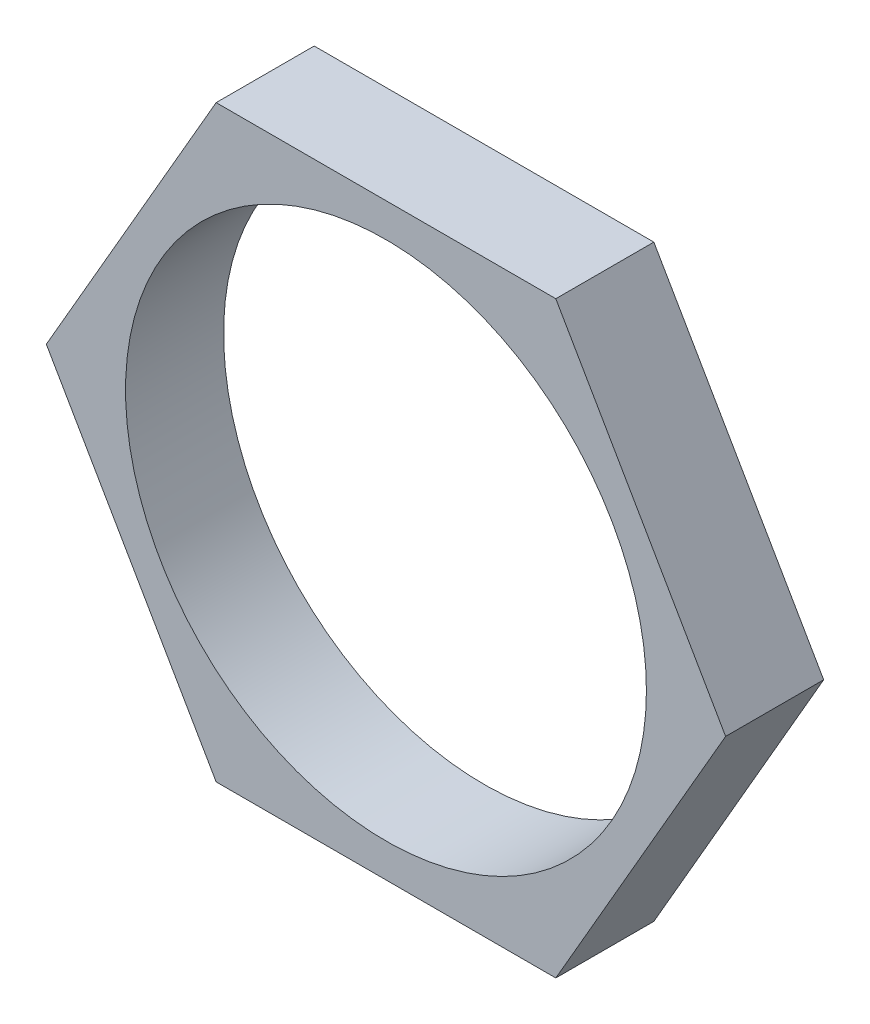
ISO-10303-21;
HEADER;
FILE_DESCRIPTION(('STEP AP214'),'2;1');
FILE_NAME('part.step','',(''),(''),'','','');
FILE_SCHEMA(('AUTOMOTIVE_DESIGN { 1 0 10303 214 1 1 1 1 }'));
ENDSEC;
DATA;
#1=APPLICATION_CONTEXT('core data for automotive mechanical design processes');
#2=APPLICATION_PROTOCOL_DEFINITION('international standard','automotive_design',2000,#1);
#3=PRODUCT_CONTEXT('',#1,'mechanical');
#4=PRODUCT('Part','Part','',(#3));
#5=PRODUCT_RELATED_PRODUCT_CATEGORY('part','',(#4));
#6=PRODUCT_DEFINITION_FORMATION('','',#4);
#7=PRODUCT_DEFINITION_CONTEXT('part definition',#1,'design');
#8=PRODUCT_DEFINITION('design','',#6,#7);
#9=PRODUCT_DEFINITION_SHAPE('','',#8);
#10=(LENGTH_UNIT() NAMED_UNIT(*) SI_UNIT(.MILLI.,.METRE.));
#11=(NAMED_UNIT(*) PLANE_ANGLE_UNIT() SI_UNIT($,.RADIAN.));
#12=(NAMED_UNIT(*) SI_UNIT($,.STERADIAN.) SOLID_ANGLE_UNIT());
#13=UNCERTAINTY_MEASURE_WITH_UNIT(LENGTH_MEASURE(1.E-05),#10,'distance_accuracy_value','');
#14=(GEOMETRIC_REPRESENTATION_CONTEXT(3) GLOBAL_UNCERTAINTY_ASSIGNED_CONTEXT((#13)) GLOBAL_UNIT_ASSIGNED_CONTEXT((#10,
#11,#12)) REPRESENTATION_CONTEXT('',''));
#15=CARTESIAN_POINT('',(0.,0.,0.));
#16=DIRECTION('',(0.,0.,1.));
#17=DIRECTION('',(1.,0.,0.));
#18=AXIS2_PLACEMENT_3D('',#15,#16,#17);
#19=CARTESIAN_POINT('',(-27.712812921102,0.,8.));
#20=DIRECTION('',(0.,0.,1.));
#21=DIRECTION('',(1.,0.,0.));
#22=AXIS2_PLACEMENT_3D('',#19,#20,#21);
#23=PLANE('',#22);
#24=DIRECTION('',(-0.5,-0.866025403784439,0.));
#25=VECTOR('',#24,1.);
#26=CARTESIAN_POINT('',(-13.856406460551,24.,8.));
#27=LINE('',#26,#25);
#28=CARTESIAN_POINT('',(-13.856406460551,24.,8.));
#29=VERTEX_POINT('',#28);
#30=CARTESIAN_POINT('',(-27.712812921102,0.,8.));
#31=VERTEX_POINT('',#30);
#32=EDGE_CURVE('E148',#29,#31,#27,.T.);
#33=ORIENTED_EDGE('',*,*,#32,.T.);
#34=DIRECTION('',(0.5,-0.866025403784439,0.));
#35=VECTOR('',#34,1.);
#36=CARTESIAN_POINT('',(-27.712812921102,0.,8.));
#37=LINE('',#36,#35);
#38=CARTESIAN_POINT('',(-13.856406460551,-24.,8.));
#39=VERTEX_POINT('',#38);
#40=EDGE_CURVE('E95',#31,#39,#37,.T.);
#41=ORIENTED_EDGE('',*,*,#40,.T.);
#42=DIRECTION('',(1.,0.,0.));
#43=VECTOR('',#42,1.);
#44=CARTESIAN_POINT('',(-13.856406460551,-24.,8.));
#45=LINE('',#44,#43);
#46=CARTESIAN_POINT('',(13.856406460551,-24.,8.));
#47=VERTEX_POINT('',#46);
#48=EDGE_CURVE('E108',#39,#47,#45,.T.);
#49=ORIENTED_EDGE('',*,*,#48,.T.);
#50=DIRECTION('',(0.5,0.866025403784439,0.));
#51=VECTOR('',#50,1.);
#52=CARTESIAN_POINT('',(13.856406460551,-24.,8.));
#53=LINE('',#52,#51);
#54=CARTESIAN_POINT('',(27.712812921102,0.,8.));
#55=VERTEX_POINT('',#54);
#56=EDGE_CURVE('E102',#47,#55,#53,.T.);
#57=ORIENTED_EDGE('',*,*,#56,.T.);
#58=DIRECTION('',(-0.5,0.866025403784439,0.));
#59=VECTOR('',#58,1.);
#60=CARTESIAN_POINT('',(27.712812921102,0.,8.));
#61=LINE('',#60,#59);
#62=CARTESIAN_POINT('',(13.856406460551,24.,8.));
#63=VERTEX_POINT('',#62);
#64=EDGE_CURVE('E106',#55,#63,#61,.T.);
#65=ORIENTED_EDGE('',*,*,#64,.T.);
#66=DIRECTION('',(-1.,0.,0.));
#67=VECTOR('',#66,1.);
#68=CARTESIAN_POINT('',(13.856406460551,24.,8.));
#69=LINE('',#68,#67);
#70=EDGE_CURVE('E58',#63,#29,#69,.T.);
#71=ORIENTED_EDGE('',*,*,#70,.T.);
#72=EDGE_LOOP('',(#33,#41,#49,#57,#65,#71));
#73=FACE_BOUND('',#72,.T.);
#74=CARTESIAN_POINT('',(0.,0.,8.));
#75=DIRECTION('',(0.,0.,1.));
#76=DIRECTION('',(1.,0.,0.));
#77=AXIS2_PLACEMENT_3D('',#74,#75,#76);
#78=CIRCLE('',#77,21.25);
#79=CARTESIAN_POINT('',(21.25,0.,8.));
#80=VERTEX_POINT('',#79);
#81=EDGE_CURVE('E136',#80,#80,#78,.T.);
#82=ORIENTED_EDGE('',*,*,#81,.F.);
#83=EDGE_LOOP('',(#82));
#84=FACE_BOUND('',#83,.T.);
#85=ADVANCED_FACE('F40',(#73,#84),#23,.T.);
#86=CARTESIAN_POINT('',(-27.712812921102,0.,0.));
#87=DIRECTION('',(0.,0.,1.));
#88=DIRECTION('',(1.,0.,0.));
#89=AXIS2_PLACEMENT_3D('',#86,#87,#88);
#90=PLANE('',#89);
#91=DIRECTION('',(-0.5,-0.866025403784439,0.));
#92=VECTOR('',#91,1.);
#93=CARTESIAN_POINT('',(-13.856406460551,24.,0.));
#94=LINE('',#93,#92);
#95=CARTESIAN_POINT('',(-13.856406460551,24.,0.));
#96=VERTEX_POINT('',#95);
#97=CARTESIAN_POINT('',(-27.712812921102,0.,0.));
#98=VERTEX_POINT('',#97);
#99=EDGE_CURVE('E131',#96,#98,#94,.T.);
#100=ORIENTED_EDGE('',*,*,#99,.F.);
#101=DIRECTION('',(-1.,0.,0.));
#102=VECTOR('',#101,1.);
#103=CARTESIAN_POINT('',(13.856406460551,24.,0.));
#104=LINE('',#103,#102);
#105=CARTESIAN_POINT('',(13.856406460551,24.,0.));
#106=VERTEX_POINT('',#105);
#107=EDGE_CURVE('E87',#106,#96,#104,.T.);
#108=ORIENTED_EDGE('',*,*,#107,.F.);
#109=DIRECTION('',(-0.5,0.866025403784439,0.));
#110=VECTOR('',#109,1.);
#111=CARTESIAN_POINT('',(27.712812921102,0.,0.));
#112=LINE('',#111,#110);
#113=CARTESIAN_POINT('',(27.712812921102,0.,0.));
#114=VERTEX_POINT('',#113);
#115=EDGE_CURVE('E81',#114,#106,#112,.T.);
#116=ORIENTED_EDGE('',*,*,#115,.F.);
#117=DIRECTION('',(0.5,0.866025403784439,0.));
#118=VECTOR('',#117,1.);
#119=CARTESIAN_POINT('',(13.856406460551,-24.,0.));
#120=LINE('',#119,#118);
#121=CARTESIAN_POINT('',(13.856406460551,-24.,0.));
#122=VERTEX_POINT('',#121);
#123=EDGE_CURVE('E117',#122,#114,#120,.T.);
#124=ORIENTED_EDGE('',*,*,#123,.F.);
#125=DIRECTION('',(1.,0.,0.));
#126=VECTOR('',#125,1.);
#127=CARTESIAN_POINT('',(-13.856406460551,-24.,0.));
#128=LINE('',#127,#126);
#129=CARTESIAN_POINT('',(-13.856406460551,-24.,0.));
#130=VERTEX_POINT('',#129);
#131=EDGE_CURVE('E139',#130,#122,#128,.T.);
#132=ORIENTED_EDGE('',*,*,#131,.F.);
#133=DIRECTION('',(0.5,-0.866025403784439,0.));
#134=VECTOR('',#133,1.);
#135=CARTESIAN_POINT('',(-27.712812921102,0.,0.));
#136=LINE('',#135,#134);
#137=EDGE_CURVE('E135',#98,#130,#136,.T.);
#138=ORIENTED_EDGE('',*,*,#137,.F.);
#139=EDGE_LOOP('',(#100,#108,#116,#124,#132,#138));
#140=FACE_BOUND('',#139,.T.);
#141=CARTESIAN_POINT('',(0.,0.,0.));
#142=DIRECTION('',(0.,0.,1.));
#143=DIRECTION('',(1.,0.,0.));
#144=AXIS2_PLACEMENT_3D('',#141,#142,#143);
#145=CIRCLE('',#144,21.25);
#146=CARTESIAN_POINT('',(21.25,0.,0.));
#147=VERTEX_POINT('',#146);
#148=EDGE_CURVE('E284',#147,#147,#145,.T.);
#149=ORIENTED_EDGE('',*,*,#148,.T.);
#150=EDGE_LOOP('',(#149));
#151=FACE_BOUND('',#150,.T.);
#152=ADVANCED_FACE('F162',(#140,#151),#90,.F.);
#153=CARTESIAN_POINT('',(-13.856406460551,24.,8.));
#154=DIRECTION('',(0.866025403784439,-0.5,0.));
#155=DIRECTION('',(0.5,0.866025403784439,0.));
#156=AXIS2_PLACEMENT_3D('',#153,#154,#155);
#157=PLANE('',#156);
#158=ORIENTED_EDGE('',*,*,#99,.T.);
#159=DIRECTION('',(0.,0.,-1.));
#160=VECTOR('',#159,1.);
#161=CARTESIAN_POINT('',(-27.712812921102,0.,8.));
#162=LINE('',#161,#160);
#163=EDGE_CURVE('E11',#31,#98,#162,.T.);
#164=ORIENTED_EDGE('',*,*,#163,.F.);
#165=ORIENTED_EDGE('',*,*,#32,.F.);
#166=DIRECTION('',(0.,0.,-1.));
#167=VECTOR('',#166,1.);
#168=CARTESIAN_POINT('',(-13.856406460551,24.,8.));
#169=LINE('',#168,#167);
#170=EDGE_CURVE('E127',#29,#96,#169,.T.);
#171=ORIENTED_EDGE('',*,*,#170,.T.);
#172=EDGE_LOOP('',(#158,#164,#165,#171));
#173=FACE_BOUND('',#172,.T.);
#174=ADVANCED_FACE('F42',(#173),#157,.F.);
#175=CARTESIAN_POINT('',(-27.712812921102,0.,8.));
#176=DIRECTION('',(0.866025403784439,0.5,0.));
#177=DIRECTION('',(-0.5,0.866025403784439,0.));
#178=AXIS2_PLACEMENT_3D('',#175,#176,#177);
#179=PLANE('',#178);
#180=ORIENTED_EDGE('',*,*,#137,.T.);
#181=DIRECTION('',(0.,0.,-1.));
#182=VECTOR('',#181,1.);
#183=CARTESIAN_POINT('',(-13.856406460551,-24.,8.));
#184=LINE('',#183,#182);
#185=EDGE_CURVE('E50',#39,#130,#184,.T.);
#186=ORIENTED_EDGE('',*,*,#185,.F.);
#187=ORIENTED_EDGE('',*,*,#40,.F.);
#188=ORIENTED_EDGE('',*,*,#163,.T.);
#189=EDGE_LOOP('',(#180,#186,#187,#188));
#190=FACE_BOUND('',#189,.T.);
#191=ADVANCED_FACE('F187',(#190),#179,.F.);
#192=CARTESIAN_POINT('',(-13.856406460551,-24.,8.));
#193=DIRECTION('',(0.,1.,0.));
#194=DIRECTION('',(-1.,0.,0.));
#195=AXIS2_PLACEMENT_3D('',#192,#193,#194);
#196=PLANE('',#195);
#197=ORIENTED_EDGE('',*,*,#131,.T.);
#198=DIRECTION('',(0.,0.,-1.));
#199=VECTOR('',#198,1.);
#200=CARTESIAN_POINT('',(13.856406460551,-24.,8.));
#201=LINE('',#200,#199);
#202=EDGE_CURVE('E119',#47,#122,#201,.T.);
#203=ORIENTED_EDGE('',*,*,#202,.F.);
#204=ORIENTED_EDGE('',*,*,#48,.F.);
#205=ORIENTED_EDGE('',*,*,#185,.T.);
#206=EDGE_LOOP('',(#197,#203,#204,#205));
#207=FACE_BOUND('',#206,.T.);
#208=ADVANCED_FACE('F159',(#207),#196,.F.);
#209=CARTESIAN_POINT('',(13.856406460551,-24.,8.));
#210=DIRECTION('',(-0.866025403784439,0.5,0.));
#211=DIRECTION('',(-0.5,-0.866025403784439,0.));
#212=AXIS2_PLACEMENT_3D('',#209,#210,#211);
#213=PLANE('',#212);
#214=ORIENTED_EDGE('',*,*,#123,.T.);
#215=DIRECTION('',(0.,0.,-1.));
#216=VECTOR('',#215,1.);
#217=CARTESIAN_POINT('',(27.712812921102,0.,8.));
#218=LINE('',#217,#216);
#219=EDGE_CURVE('E114',#55,#114,#218,.T.);
#220=ORIENTED_EDGE('',*,*,#219,.F.);
#221=ORIENTED_EDGE('',*,*,#56,.F.);
#222=ORIENTED_EDGE('',*,*,#202,.T.);
#223=EDGE_LOOP('',(#214,#220,#221,#222));
#224=FACE_BOUND('',#223,.T.);
#225=ADVANCED_FACE('F115',(#224),#213,.F.);
#226=CARTESIAN_POINT('',(27.712812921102,0.,8.));
#227=DIRECTION('',(-0.866025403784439,-0.5,0.));
#228=DIRECTION('',(0.5,-0.866025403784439,0.));
#229=AXIS2_PLACEMENT_3D('',#226,#227,#228);
#230=PLANE('',#229);
#231=ORIENTED_EDGE('',*,*,#115,.T.);
#232=DIRECTION('',(0.,0.,-1.));
#233=VECTOR('',#232,1.);
#234=CARTESIAN_POINT('',(13.856406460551,24.,8.));
#235=LINE('',#234,#233);
#236=EDGE_CURVE('E120',#63,#106,#235,.T.);
#237=ORIENTED_EDGE('',*,*,#236,.F.);
#238=ORIENTED_EDGE('',*,*,#64,.F.);
#239=ORIENTED_EDGE('',*,*,#219,.T.);
#240=EDGE_LOOP('',(#231,#237,#238,#239));
#241=FACE_BOUND('',#240,.T.);
#242=ADVANCED_FACE('F122',(#241),#230,.F.);
#243=CARTESIAN_POINT('',(13.856406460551,24.,8.));
#244=DIRECTION('',(0.,-1.,0.));
#245=DIRECTION('',(1.,0.,0.));
#246=AXIS2_PLACEMENT_3D('',#243,#244,#245);
#247=PLANE('',#246);
#248=ORIENTED_EDGE('',*,*,#107,.T.);
#249=ORIENTED_EDGE('',*,*,#170,.F.);
#250=ORIENTED_EDGE('',*,*,#70,.F.);
#251=ORIENTED_EDGE('',*,*,#236,.T.);
#252=EDGE_LOOP('',(#248,#249,#250,#251));
#253=FACE_BOUND('',#252,.T.);
#254=ADVANCED_FACE('F167',(#253),#247,.F.);
#255=CARTESIAN_POINT('',(0.,0.,8.));
#256=DIRECTION('',(0.,0.,-1.));
#257=DIRECTION('',(-1.,0.,0.));
#258=AXIS2_PLACEMENT_3D('',#255,#256,#257);
#259=CYLINDRICAL_SURFACE('',#258,21.25);
#260=ORIENTED_EDGE('',*,*,#81,.T.);
#261=EDGE_LOOP('',(#260));
#262=FACE_BOUND('',#261,.T.);
#263=ORIENTED_EDGE('',*,*,#148,.F.);
#264=EDGE_LOOP('',(#263));
#265=FACE_BOUND('',#264,.T.);
#266=ADVANCED_FACE('F169',(#262,#265),#259,.F.);
#267=CLOSED_SHELL('',(#85,#152,#174,#191,#208,#225,#242,#254,#266));
#268=MANIFOLD_SOLID_BREP('B2',#267);
#269=ADVANCED_BREP_SHAPE_REPRESENTATION('',(#18,#268),#14);
#270=SHAPE_DEFINITION_REPRESENTATION(#9,#269);
ENDSEC;
END-ISO-10303-21;
